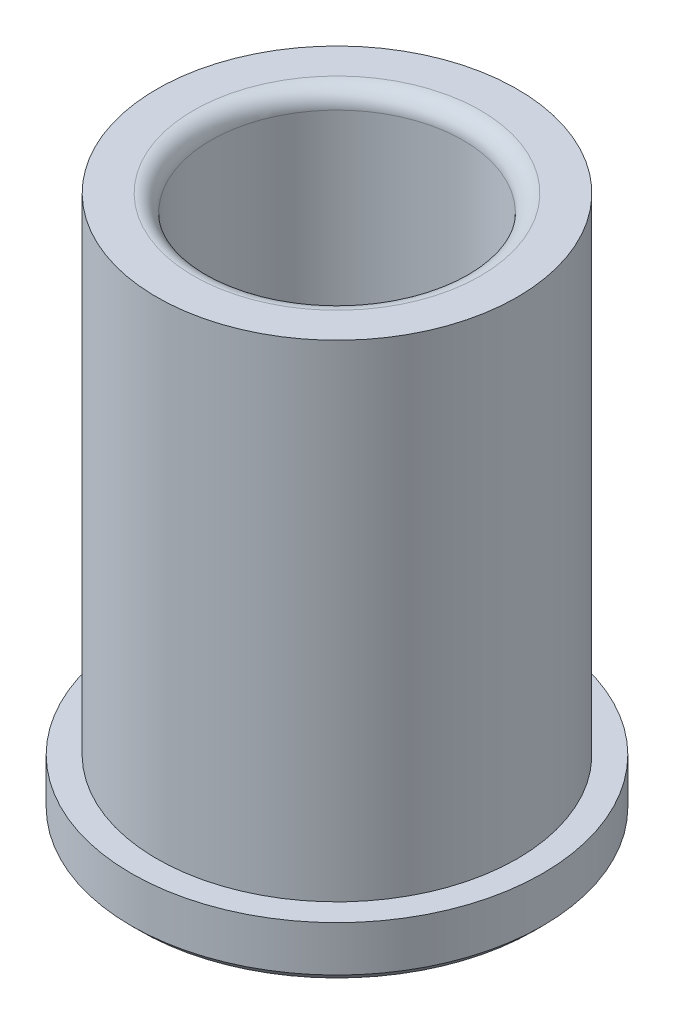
ISO-10303-21;
HEADER;
FILE_DESCRIPTION(('STEP AP214'),'2;1');
FILE_NAME('part.step','',(''),(''),'','','');
FILE_SCHEMA(('AUTOMOTIVE_DESIGN { 1 0 10303 214 1 1 1 1 }'));
ENDSEC;
DATA;
#1=APPLICATION_CONTEXT('core data for automotive mechanical design processes');
#2=APPLICATION_PROTOCOL_DEFINITION('international standard','automotive_design',2000,#1);
#3=PRODUCT_CONTEXT('',#1,'mechanical');
#4=PRODUCT('Part','Part','',(#3));
#5=PRODUCT_RELATED_PRODUCT_CATEGORY('part','',(#4));
#6=PRODUCT_DEFINITION_FORMATION('','',#4);
#7=PRODUCT_DEFINITION_CONTEXT('part definition',#1,'design');
#8=PRODUCT_DEFINITION('design','',#6,#7);
#9=PRODUCT_DEFINITION_SHAPE('','',#8);
#10=(LENGTH_UNIT() NAMED_UNIT(*) SI_UNIT(.MILLI.,.METRE.));
#11=(NAMED_UNIT(*) PLANE_ANGLE_UNIT() SI_UNIT($,.RADIAN.));
#12=(NAMED_UNIT(*) SI_UNIT($,.STERADIAN.) SOLID_ANGLE_UNIT());
#13=UNCERTAINTY_MEASURE_WITH_UNIT(LENGTH_MEASURE(1.E-05),#10,'distance_accuracy_value','');
#14=(GEOMETRIC_REPRESENTATION_CONTEXT(3) GLOBAL_UNCERTAINTY_ASSIGNED_CONTEXT((#13)) GLOBAL_UNIT_ASSIGNED_CONTEXT((#10,
#11,#12)) REPRESENTATION_CONTEXT('',''));
#15=CARTESIAN_POINT('',(0.,0.,0.));
#16=DIRECTION('',(0.,0.,1.));
#17=DIRECTION('',(1.,0.,0.));
#18=AXIS2_PLACEMENT_3D('',#15,#16,#17);
#19=CARTESIAN_POINT('',(3.49148336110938E-12,-1000.,0.));
#20=DIRECTION('',(0.,-1.,0.));
#21=DIRECTION('',(1.,0.,0.));
#22=AXIS2_PLACEMENT_3D('',#19,#20,#21);
#23=CYLINDRICAL_SURFACE('',#22,15.8813499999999);
#24=CARTESIAN_POINT('',(0.,4.7625,0.));
#25=DIRECTION('',(0.,-1.,0.));
#26=DIRECTION('',(1.,0.,0.));
#27=AXIS2_PLACEMENT_3D('',#24,#25,#26);
#28=CIRCLE('',#27,15.88135);
#29=CARTESIAN_POINT('',(15.8813499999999,4.76250000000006,0.));
#30=VERTEX_POINT('',#29);
#31=EDGE_CURVE('E60',#30,#30,#28,.T.);
#32=ORIENTED_EDGE('',*,*,#31,.F.);
#33=EDGE_LOOP('',(#32));
#34=FACE_BOUND('',#33,.T.);
#35=CARTESIAN_POINT('',(-1.66281895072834E-13,47.625,0.));
#36=DIRECTION('',(0.,-1.,0.));
#37=DIRECTION('',(1.,0.,0.));
#38=AXIS2_PLACEMENT_3D('',#35,#36,#37);
#39=CIRCLE('',#38,15.8813499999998);
#40=CARTESIAN_POINT('',(15.8813499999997,47.6250000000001,0.));
#41=VERTEX_POINT('',#40);
#42=EDGE_CURVE('E39',#41,#41,#39,.T.);
#43=ORIENTED_EDGE('',*,*,#42,.T.);
#44=EDGE_LOOP('',(#43));
#45=FACE_BOUND('',#44,.T.);
#46=ADVANCED_FACE('F28',(#34,#45),#23,.T.);
#47=CARTESIAN_POINT('',(-15.88135,47.625,0.));
#48=DIRECTION('',(0.,-1.,0.));
#49=DIRECTION('',(1.,0.,0.));
#50=AXIS2_PLACEMENT_3D('',#47,#48,#49);
#51=PLANE('',#50);
#52=CARTESIAN_POINT('',(-1.66281895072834E-13,47.625,0.));
#53=DIRECTION('',(0.,-1.,0.));
#54=DIRECTION('',(1.,0.,0.));
#55=AXIS2_PLACEMENT_3D('',#52,#53,#54);
#56=CIRCLE('',#55,12.6428499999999);
#57=CARTESIAN_POINT('',(12.6428499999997,47.6250000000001,0.));
#58=VERTEX_POINT('',#57);
#59=EDGE_CURVE('E35',#58,#58,#56,.T.);
#60=ORIENTED_EDGE('',*,*,#59,.T.);
#61=EDGE_LOOP('',(#60));
#62=FACE_BOUND('',#61,.T.);
#63=ORIENTED_EDGE('',*,*,#42,.F.);
#64=EDGE_LOOP('',(#63));
#65=FACE_BOUND('',#64,.T.);
#66=ADVANCED_FACE('F68',(#62,#65),#51,.F.);
#67=CARTESIAN_POINT('',(3.49148336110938E-12,-1000.,0.));
#68=DIRECTION('',(0.,-1.,0.));
#69=DIRECTION('',(1.,0.,0.));
#70=AXIS2_PLACEMENT_3D('',#67,#68,#69);
#71=CYLINDRICAL_SURFACE('',#70,11.1188499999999);
#72=CARTESIAN_POINT('',(-1.60960874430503E-13,46.1009999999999,0.));
#73=DIRECTION('',(0.,-1.,0.));
#74=DIRECTION('',(1.,0.,0.));
#75=AXIS2_PLACEMENT_3D('',#72,#73,#74);
#76=CIRCLE('',#75,11.1188499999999);
#77=CARTESIAN_POINT('',(11.1188499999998,46.101,0.));
#78=VERTEX_POINT('',#77);
#79=EDGE_CURVE('E10',#78,#78,#76,.F.);
#80=ORIENTED_EDGE('',*,*,#79,.T.);
#81=EDGE_LOOP('',(#80));
#82=FACE_BOUND('',#81,.T.);
#83=CARTESIAN_POINT('',(0.,0.761999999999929,0.));
#84=DIRECTION('',(0.,-1.,0.));
#85=DIRECTION('',(1.,0.,0.));
#86=AXIS2_PLACEMENT_3D('',#83,#84,#85);
#87=CIRCLE('',#86,11.11885);
#88=CARTESIAN_POINT('',(11.11885,0.761999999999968,0.));
#89=VERTEX_POINT('',#88);
#90=EDGE_CURVE('E43',#89,#89,#87,.T.);
#91=ORIENTED_EDGE('',*,*,#90,.T.);
#92=EDGE_LOOP('',(#91));
#93=FACE_BOUND('',#92,.T.);
#94=ADVANCED_FACE('F72',(#82,#93),#71,.F.);
#95=CARTESIAN_POINT('',(0.,0.,0.));
#96=DIRECTION('',(0.,-1.,0.));
#97=DIRECTION('',(1.,0.,0.));
#98=AXIS2_PLACEMENT_3D('',#95,#96,#97);
#99=CONICAL_SURFACE('',#98,11.88085,0.785398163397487);
#100=ORIENTED_EDGE('',*,*,#90,.F.);
#101=EDGE_LOOP('',(#100));
#102=FACE_BOUND('',#101,.T.);
#103=CARTESIAN_POINT('',(0.,0.,0.));
#104=DIRECTION('',(0.,-1.,0.));
#105=DIRECTION('',(1.,0.,0.));
#106=AXIS2_PLACEMENT_3D('',#103,#104,#105);
#107=CIRCLE('',#106,11.88085);
#108=CARTESIAN_POINT('',(11.88085,0.,0.));
#109=VERTEX_POINT('',#108);
#110=EDGE_CURVE('E48',#109,#109,#107,.T.);
#111=ORIENTED_EDGE('',*,*,#110,.T.);
#112=EDGE_LOOP('',(#111));
#113=FACE_BOUND('',#112,.T.);
#114=ADVANCED_FACE('F77',(#102,#113),#99,.F.);
#115=CARTESIAN_POINT('',(-11.88085,0.,0.));
#116=DIRECTION('',(0.,1.,0.));
#117=DIRECTION('',(-1.,0.,0.));
#118=AXIS2_PLACEMENT_3D('',#115,#116,#117);
#119=PLANE('',#118);
#120=ORIENTED_EDGE('',*,*,#110,.F.);
#121=EDGE_LOOP('',(#120));
#122=FACE_BOUND('',#121,.T.);
#123=CARTESIAN_POINT('',(0.,0.,0.));
#124=DIRECTION('',(0.,-1.,0.));
#125=DIRECTION('',(1.,0.,0.));
#126=AXIS2_PLACEMENT_3D('',#123,#124,#125);
#127=CIRCLE('',#126,17.3609);
#128=CARTESIAN_POINT('',(17.3609,0.,0.));
#129=VERTEX_POINT('',#128);
#130=EDGE_CURVE('E51',#129,#129,#127,.T.);
#131=ORIENTED_EDGE('',*,*,#130,.T.);
#132=EDGE_LOOP('',(#131));
#133=FACE_BOUND('',#132,.T.);
#134=ADVANCED_FACE('F82',(#122,#133),#119,.F.);
#135=CARTESIAN_POINT('',(0.,0.761999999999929,0.));
#136=DIRECTION('',(0.,1.,0.));
#137=DIRECTION('',(-1.,0.,0.));
#138=AXIS2_PLACEMENT_3D('',#135,#136,#137);
#139=CONICAL_SURFACE('',#138,18.1229,0.785398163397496);
#140=ORIENTED_EDGE('',*,*,#130,.F.);
#141=EDGE_LOOP('',(#140));
#142=FACE_BOUND('',#141,.T.);
#143=CARTESIAN_POINT('',(0.,0.761999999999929,0.));
#144=DIRECTION('',(0.,-1.,0.));
#145=DIRECTION('',(1.,0.,0.));
#146=AXIS2_PLACEMENT_3D('',#143,#144,#145);
#147=CIRCLE('',#146,18.1229);
#148=CARTESIAN_POINT('',(18.1229,0.761999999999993,0.));
#149=VERTEX_POINT('',#148);
#150=EDGE_CURVE('E54',#149,#149,#147,.T.);
#151=ORIENTED_EDGE('',*,*,#150,.T.);
#152=EDGE_LOOP('',(#151));
#153=FACE_BOUND('',#152,.T.);
#154=ADVANCED_FACE('F86',(#142,#153),#139,.T.);
#155=CARTESIAN_POINT('',(3.49148336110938E-12,-1000.,0.));
#156=DIRECTION('',(0.,-1.,0.));
#157=DIRECTION('',(1.,0.,0.));
#158=AXIS2_PLACEMENT_3D('',#155,#156,#157);
#159=CYLINDRICAL_SURFACE('',#158,18.1229);
#160=ORIENTED_EDGE('',*,*,#150,.F.);
#161=EDGE_LOOP('',(#160));
#162=FACE_BOUND('',#161,.T.);
#163=CARTESIAN_POINT('',(0.,4.7625,0.));
#164=DIRECTION('',(0.,-1.,0.));
#165=DIRECTION('',(1.,0.,0.));
#166=AXIS2_PLACEMENT_3D('',#163,#164,#165);
#167=CIRCLE('',#166,18.1229);
#168=CARTESIAN_POINT('',(18.1229,4.76250000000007,0.));
#169=VERTEX_POINT('',#168);
#170=EDGE_CURVE('E57',#169,#169,#167,.T.);
#171=ORIENTED_EDGE('',*,*,#170,.T.);
#172=EDGE_LOOP('',(#171));
#173=FACE_BOUND('',#172,.T.);
#174=ADVANCED_FACE('F90',(#162,#173),#159,.T.);
#175=CARTESIAN_POINT('',(-18.1229,4.76249999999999,0.));
#176=DIRECTION('',(0.,-1.,0.));
#177=DIRECTION('',(1.,0.,0.));
#178=AXIS2_PLACEMENT_3D('',#175,#176,#177);
#179=PLANE('',#178);
#180=ORIENTED_EDGE('',*,*,#170,.F.);
#181=EDGE_LOOP('',(#180));
#182=FACE_BOUND('',#181,.T.);
#183=ORIENTED_EDGE('',*,*,#31,.T.);
#184=EDGE_LOOP('',(#183));
#185=FACE_BOUND('',#184,.T.);
#186=ADVANCED_FACE('F64',(#182,#185),#179,.F.);
#187=CARTESIAN_POINT('',(-1.60960874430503E-13,46.1009999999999,0.));
#188=DIRECTION('',(0.,-1.,0.));
#189=DIRECTION('',(1.,0.,0.));
#190=AXIS2_PLACEMENT_3D('',#187,#188,#189);
#191=TOROIDAL_SURFACE('',#190,12.6428499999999,1.524);
#192=ORIENTED_EDGE('',*,*,#79,.F.);
#193=EDGE_LOOP('',(#192));
#194=FACE_BOUND('',#193,.T.);
#195=ORIENTED_EDGE('',*,*,#59,.F.);
#196=EDGE_LOOP('',(#195));
#197=FACE_BOUND('',#196,.T.);
#198=ADVANCED_FACE('F30',(#194,#197),#191,.T.);
#199=CLOSED_SHELL('',(#46,#66,#94,#114,#134,#154,#174,#186,#198));
#200=MANIFOLD_SOLID_BREP('B2',#199);
#201=ADVANCED_BREP_SHAPE_REPRESENTATION('',(#18,#200),#14);
#202=SHAPE_DEFINITION_REPRESENTATION(#9,#201);
ENDSEC;
END-ISO-10303-21;
